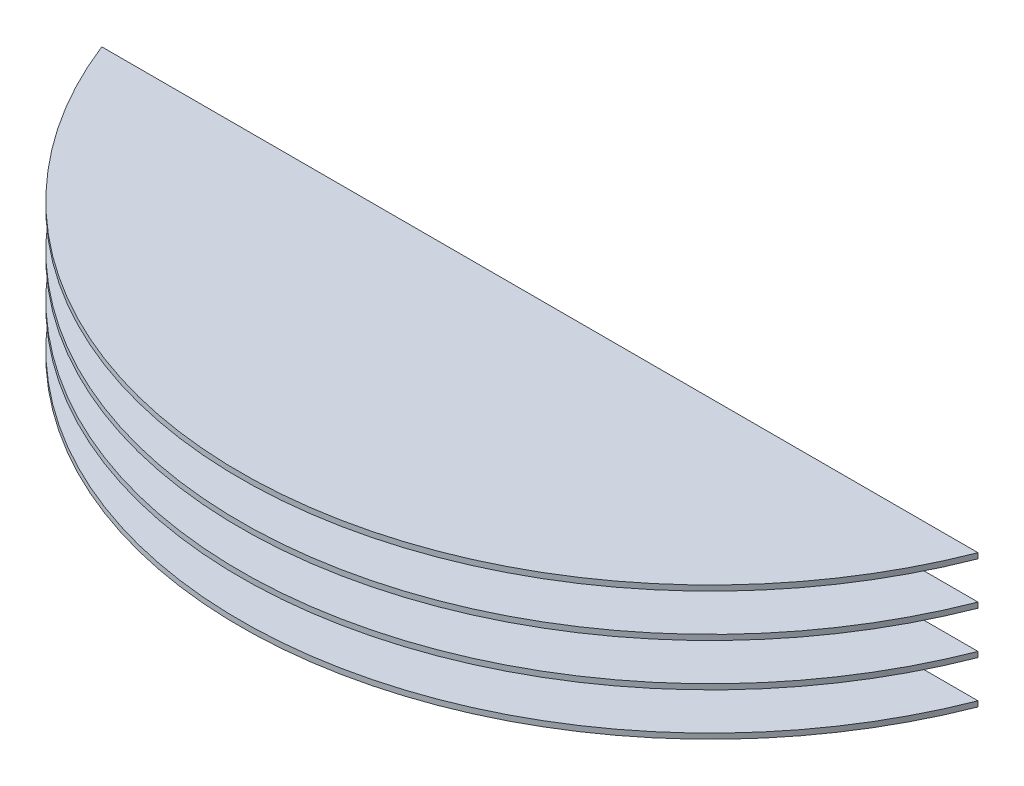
ISO-10303-21;
HEADER;
FILE_DESCRIPTION(('STEP AP214'),'2;1');
FILE_NAME('part.step','',(''),(''),'','','');
FILE_SCHEMA(('AUTOMOTIVE_DESIGN { 1 0 10303 214 1 1 1 1 }'));
ENDSEC;
DATA;
#1=APPLICATION_CONTEXT('core data for automotive mechanical design processes');
#2=APPLICATION_PROTOCOL_DEFINITION('international standard','automotive_design',2000,#1);
#3=PRODUCT_CONTEXT('',#1,'mechanical');
#4=PRODUCT('Part','Part','',(#3));
#5=PRODUCT_RELATED_PRODUCT_CATEGORY('part','',(#4));
#6=PRODUCT_DEFINITION_FORMATION('','',#4);
#7=PRODUCT_DEFINITION_CONTEXT('part definition',#1,'design');
#8=PRODUCT_DEFINITION('design','',#6,#7);
#9=PRODUCT_DEFINITION_SHAPE('','',#8);
#10=(LENGTH_UNIT() NAMED_UNIT(*) SI_UNIT(.MILLI.,.METRE.));
#11=(NAMED_UNIT(*) PLANE_ANGLE_UNIT() SI_UNIT($,.RADIAN.));
#12=(NAMED_UNIT(*) SI_UNIT($,.STERADIAN.) SOLID_ANGLE_UNIT());
#13=UNCERTAINTY_MEASURE_WITH_UNIT(LENGTH_MEASURE(1.E-05),#10,'distance_accuracy_value','');
#14=(GEOMETRIC_REPRESENTATION_CONTEXT(3) GLOBAL_UNCERTAINTY_ASSIGNED_CONTEXT((#13)) GLOBAL_UNIT_ASSIGNED_CONTEXT((#10,
#11,#12)) REPRESENTATION_CONTEXT('',''));
#15=CARTESIAN_POINT('',(0.,0.,0.));
#16=DIRECTION('',(0.,0.,1.));
#17=DIRECTION('',(1.,0.,0.));
#18=AXIS2_PLACEMENT_3D('',#15,#16,#17);
#19=CARTESIAN_POINT('',(38.1000000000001,30.1625,-2.66050878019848E-13));
#20=DIRECTION('',(0.,-1.,0.));
#21=DIRECTION('',(0.,0.,-1.));
#22=AXIS2_PLACEMENT_3D('',#19,#20,#21);
#23=PLANE('',#22);
#24=CARTESIAN_POINT('',(0.,30.1625,0.));
#25=DIRECTION('',(0.,-1.,0.));
#26=DIRECTION('',(0.,0.,-1.));
#27=AXIS2_PLACEMENT_3D('',#24,#25,#26);
#28=CIRCLE('',#27,139.7);
#29=CARTESIAN_POINT('',(130.136274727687,30.1625,50.8));
#30=VERTEX_POINT('',#29);
#31=CARTESIAN_POINT('',(-130.136274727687,30.1625,50.8));
#32=VERTEX_POINT('',#31);
#33=EDGE_CURVE('E53',#30,#32,#28,.T.);
#34=ORIENTED_EDGE('',*,*,#33,.F.);
#35=DIRECTION('',(1.,0.,0.));
#36=VECTOR('',#35,1.);
#37=CARTESIAN_POINT('',(0.,30.1625,50.8));
#38=LINE('',#37,#36);
#39=EDGE_CURVE('E70',#32,#30,#38,.T.);
#40=ORIENTED_EDGE('',*,*,#39,.F.);
#41=EDGE_LOOP('',(#34,#40));
#42=FACE_BOUND('',#41,.T.);
#43=ADVANCED_FACE('F46',(#42),#23,.F.);
#44=CARTESIAN_POINT('',(0.,-0.802394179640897,0.));
#45=DIRECTION('',(0.,-1.,0.));
#46=DIRECTION('',(0.,0.,-1.));
#47=AXIS2_PLACEMENT_3D('',#44,#45,#46);
#48=CYLINDRICAL_SURFACE('',#47,139.7);
#49=ORIENTED_EDGE('',*,*,#33,.T.);
#50=DIRECTION('',(0.,-1.,0.));
#51=VECTOR('',#50,1.);
#52=CARTESIAN_POINT('',(-130.136274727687,-0.802394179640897,50.8));
#53=LINE('',#52,#51);
#54=CARTESIAN_POINT('',(-130.136274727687,28.575,50.8));
#55=VERTEX_POINT('',#54);
#56=EDGE_CURVE('E67',#32,#55,#53,.T.);
#57=ORIENTED_EDGE('',*,*,#56,.T.);
#58=CARTESIAN_POINT('',(0.,28.575,0.));
#59=DIRECTION('',(0.,-1.,0.));
#60=DIRECTION('',(0.,0.,-1.));
#61=AXIS2_PLACEMENT_3D('',#58,#59,#60);
#62=CIRCLE('',#61,139.7);
#63=CARTESIAN_POINT('',(130.136274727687,28.575,50.8));
#64=VERTEX_POINT('',#63);
#65=EDGE_CURVE('E75',#64,#55,#62,.T.);
#66=ORIENTED_EDGE('',*,*,#65,.F.);
#67=DIRECTION('',(0.,-1.,0.));
#68=VECTOR('',#67,1.);
#69=CARTESIAN_POINT('',(130.136274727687,-0.802394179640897,50.8));
#70=LINE('',#69,#68);
#71=EDGE_CURVE('E60',#64,#30,#70,.F.);
#72=ORIENTED_EDGE('',*,*,#71,.T.);
#73=EDGE_LOOP('',(#49,#57,#66,#72));
#74=FACE_BOUND('',#73,.T.);
#75=ADVANCED_FACE('F80',(#74),#48,.T.);
#76=CARTESIAN_POINT('',(38.1000000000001,28.575,-2.66050878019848E-13));
#77=DIRECTION('',(0.,1.,0.));
#78=DIRECTION('',(0.,0.,1.));
#79=AXIS2_PLACEMENT_3D('',#76,#77,#78);
#80=PLANE('',#79);
#81=ORIENTED_EDGE('',*,*,#65,.T.);
#82=DIRECTION('',(1.,0.,0.));
#83=VECTOR('',#82,1.);
#84=CARTESIAN_POINT('',(38.1000000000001,28.575,50.8));
#85=LINE('',#84,#83);
#86=EDGE_CURVE('E12',#55,#64,#85,.T.);
#87=ORIENTED_EDGE('',*,*,#86,.T.);
#88=EDGE_LOOP('',(#81,#87));
#89=FACE_BOUND('',#88,.T.);
#90=ADVANCED_FACE('F84',(#89),#80,.F.);
#91=CARTESIAN_POINT('',(0.,-9.52500000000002,50.8));
#92=DIRECTION('',(0.,0.,1.));
#93=DIRECTION('',(1.,0.,0.));
#94=AXIS2_PLACEMENT_3D('',#91,#92,#93);
#95=PLANE('',#94);
#96=ORIENTED_EDGE('',*,*,#39,.T.);
#97=ORIENTED_EDGE('',*,*,#71,.F.);
#98=ORIENTED_EDGE('',*,*,#86,.F.);
#99=ORIENTED_EDGE('',*,*,#56,.F.);
#100=EDGE_LOOP('',(#96,#97,#98,#99));
#101=FACE_BOUND('',#100,.T.);
#102=ADVANCED_FACE('F69',(#101),#95,.F.);
#103=CLOSED_SHELL('',(#43,#75,#90,#102));
#104=MANIFOLD_SOLID_BREP('B2',#103);
#105=CARTESIAN_POINT('',(38.1000000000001,17.4625,-2.66050878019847E-13));
#106=DIRECTION('',(0.,-1.,0.));
#107=DIRECTION('',(0.,0.,-1.));
#108=AXIS2_PLACEMENT_3D('',#105,#106,#107);
#109=PLANE('',#108);
#110=CARTESIAN_POINT('',(0.,17.4625,0.));
#111=DIRECTION('',(0.,-1.,0.));
#112=DIRECTION('',(0.,0.,-1.));
#113=AXIS2_PLACEMENT_3D('',#110,#111,#112);
#114=CIRCLE('',#113,139.7);
#115=CARTESIAN_POINT('',(130.136274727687,17.4625,50.8));
#116=VERTEX_POINT('',#115);
#117=CARTESIAN_POINT('',(-130.136274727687,17.4625,50.8));
#118=VERTEX_POINT('',#117);
#119=EDGE_CURVE('E138',#116,#118,#114,.T.);
#120=ORIENTED_EDGE('',*,*,#119,.F.);
#121=DIRECTION('',(-1.,0.,0.));
#122=VECTOR('',#121,1.);
#123=CARTESIAN_POINT('',(38.1000000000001,17.4625,50.8));
#124=LINE('',#123,#122);
#125=EDGE_CURVE('E163',#116,#118,#124,.T.);
#126=ORIENTED_EDGE('',*,*,#125,.T.);
#127=EDGE_LOOP('',(#120,#126));
#128=FACE_BOUND('',#127,.T.);
#129=ADVANCED_FACE('F131',(#128),#109,.F.);
#130=CARTESIAN_POINT('',(0.,-0.802394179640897,0.));
#131=DIRECTION('',(0.,-1.,0.));
#132=DIRECTION('',(0.,0.,-1.));
#133=AXIS2_PLACEMENT_3D('',#130,#131,#132);
#134=CYLINDRICAL_SURFACE('',#133,139.7);
#135=ORIENTED_EDGE('',*,*,#119,.T.);
#136=DIRECTION('',(0.,-1.,0.));
#137=VECTOR('',#136,1.);
#138=CARTESIAN_POINT('',(-130.136274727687,-0.802394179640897,50.8));
#139=LINE('',#138,#137);
#140=CARTESIAN_POINT('',(-130.136274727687,15.875,50.8));
#141=VERTEX_POINT('',#140);
#142=EDGE_CURVE('E149',#118,#141,#139,.T.);
#143=ORIENTED_EDGE('',*,*,#142,.T.);
#144=CARTESIAN_POINT('',(0.,15.875,0.));
#145=DIRECTION('',(0.,-1.,0.));
#146=DIRECTION('',(0.,0.,-1.));
#147=AXIS2_PLACEMENT_3D('',#144,#145,#146);
#148=CIRCLE('',#147,139.7);
#149=CARTESIAN_POINT('',(130.136274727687,15.875,50.8));
#150=VERTEX_POINT('',#149);
#151=EDGE_CURVE('E161',#150,#141,#148,.T.);
#152=ORIENTED_EDGE('',*,*,#151,.F.);
#153=DIRECTION('',(0.,-1.,0.));
#154=VECTOR('',#153,1.);
#155=CARTESIAN_POINT('',(130.136274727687,-0.802394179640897,50.8));
#156=LINE('',#155,#154);
#157=EDGE_CURVE('E145',#150,#116,#156,.F.);
#158=ORIENTED_EDGE('',*,*,#157,.T.);
#159=EDGE_LOOP('',(#135,#143,#152,#158));
#160=FACE_BOUND('',#159,.T.);
#161=ADVANCED_FACE('F160',(#160),#134,.T.);
#162=CARTESIAN_POINT('',(38.1000000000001,15.875,-2.66050878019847E-13));
#163=DIRECTION('',(0.,1.,0.));
#164=DIRECTION('',(0.,0.,1.));
#165=AXIS2_PLACEMENT_3D('',#162,#163,#164);
#166=PLANE('',#165);
#167=ORIENTED_EDGE('',*,*,#151,.T.);
#168=DIRECTION('',(1.,0.,0.));
#169=VECTOR('',#168,1.);
#170=CARTESIAN_POINT('',(38.1000000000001,15.875,50.8));
#171=LINE('',#170,#169);
#172=EDGE_CURVE('E44',#141,#150,#171,.T.);
#173=ORIENTED_EDGE('',*,*,#172,.T.);
#174=EDGE_LOOP('',(#167,#173));
#175=FACE_BOUND('',#174,.T.);
#176=ADVANCED_FACE('F165',(#175),#166,.F.);
#177=CARTESIAN_POINT('',(0.,-9.52500000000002,50.8));
#178=DIRECTION('',(0.,0.,1.));
#179=DIRECTION('',(1.,0.,0.));
#180=AXIS2_PLACEMENT_3D('',#177,#178,#179);
#181=PLANE('',#180);
#182=ORIENTED_EDGE('',*,*,#157,.F.);
#183=ORIENTED_EDGE('',*,*,#172,.F.);
#184=ORIENTED_EDGE('',*,*,#142,.F.);
#185=ORIENTED_EDGE('',*,*,#125,.F.);
#186=EDGE_LOOP('',(#182,#183,#184,#185));
#187=FACE_BOUND('',#186,.T.);
#188=ADVANCED_FACE('F154',(#187),#181,.F.);
#189=CLOSED_SHELL('',(#129,#161,#176,#188));
#190=MANIFOLD_SOLID_BREP('B6',#189);
#191=CARTESIAN_POINT('',(38.1,4.76249999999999,-2.66050878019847E-13));
#192=DIRECTION('',(0.,-1.,0.));
#193=DIRECTION('',(0.,0.,-1.));
#194=AXIS2_PLACEMENT_3D('',#191,#192,#193);
#195=PLANE('',#194);
#196=CARTESIAN_POINT('',(0.,4.76249999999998,0.));
#197=DIRECTION('',(0.,-1.,0.));
#198=DIRECTION('',(0.,0.,-1.));
#199=AXIS2_PLACEMENT_3D('',#196,#197,#198);
#200=CIRCLE('',#199,139.7);
#201=CARTESIAN_POINT('',(130.136274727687,4.76249999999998,50.8));
#202=VERTEX_POINT('',#201);
#203=CARTESIAN_POINT('',(-130.136274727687,4.76249999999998,50.8));
#204=VERTEX_POINT('',#203);
#205=EDGE_CURVE('E222',#202,#204,#200,.T.);
#206=ORIENTED_EDGE('',*,*,#205,.F.);
#207=DIRECTION('',(-1.,0.,0.));
#208=VECTOR('',#207,1.);
#209=CARTESIAN_POINT('',(38.1000000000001,4.76249999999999,50.8));
#210=LINE('',#209,#208);
#211=EDGE_CURVE('E247',#202,#204,#210,.T.);
#212=ORIENTED_EDGE('',*,*,#211,.T.);
#213=EDGE_LOOP('',(#206,#212));
#214=FACE_BOUND('',#213,.T.);
#215=ADVANCED_FACE('F215',(#214),#195,.F.);
#216=CARTESIAN_POINT('',(0.,-0.802394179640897,0.));
#217=DIRECTION('',(0.,-1.,0.));
#218=DIRECTION('',(0.,0.,-1.));
#219=AXIS2_PLACEMENT_3D('',#216,#217,#218);
#220=CYLINDRICAL_SURFACE('',#219,139.7);
#221=ORIENTED_EDGE('',*,*,#205,.T.);
#222=DIRECTION('',(0.,-1.,0.));
#223=VECTOR('',#222,1.);
#224=CARTESIAN_POINT('',(-130.136274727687,-0.802394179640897,50.8));
#225=LINE('',#224,#223);
#226=CARTESIAN_POINT('',(-130.136274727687,3.17499999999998,50.8));
#227=VERTEX_POINT('',#226);
#228=EDGE_CURVE('E233',#204,#227,#225,.T.);
#229=ORIENTED_EDGE('',*,*,#228,.T.);
#230=CARTESIAN_POINT('',(0.,3.17499999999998,0.));
#231=DIRECTION('',(0.,-1.,0.));
#232=DIRECTION('',(0.,0.,-1.));
#233=AXIS2_PLACEMENT_3D('',#230,#231,#232);
#234=CIRCLE('',#233,139.7);
#235=CARTESIAN_POINT('',(130.136274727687,3.17499999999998,50.8));
#236=VERTEX_POINT('',#235);
#237=EDGE_CURVE('E245',#236,#227,#234,.T.);
#238=ORIENTED_EDGE('',*,*,#237,.F.);
#239=DIRECTION('',(0.,-1.,0.));
#240=VECTOR('',#239,1.);
#241=CARTESIAN_POINT('',(130.136274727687,-0.802394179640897,50.8));
#242=LINE('',#241,#240);
#243=EDGE_CURVE('E229',#236,#202,#242,.F.);
#244=ORIENTED_EDGE('',*,*,#243,.T.);
#245=EDGE_LOOP('',(#221,#229,#238,#244));
#246=FACE_BOUND('',#245,.T.);
#247=ADVANCED_FACE('F244',(#246),#220,.T.);
#248=CARTESIAN_POINT('',(38.1,3.17499999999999,-2.66050878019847E-13));
#249=DIRECTION('',(0.,1.,0.));
#250=DIRECTION('',(0.,0.,1.));
#251=AXIS2_PLACEMENT_3D('',#248,#249,#250);
#252=PLANE('',#251);
#253=ORIENTED_EDGE('',*,*,#237,.T.);
#254=DIRECTION('',(1.,0.,0.));
#255=VECTOR('',#254,1.);
#256=CARTESIAN_POINT('',(38.1000000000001,3.17499999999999,50.8));
#257=LINE('',#256,#255);
#258=EDGE_CURVE('E129',#227,#236,#257,.T.);
#259=ORIENTED_EDGE('',*,*,#258,.T.);
#260=EDGE_LOOP('',(#253,#259));
#261=FACE_BOUND('',#260,.T.);
#262=ADVANCED_FACE('F249',(#261),#252,.F.);
#263=CARTESIAN_POINT('',(0.,-9.52500000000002,50.8));
#264=DIRECTION('',(0.,0.,1.));
#265=DIRECTION('',(1.,0.,0.));
#266=AXIS2_PLACEMENT_3D('',#263,#264,#265);
#267=PLANE('',#266);
#268=ORIENTED_EDGE('',*,*,#243,.F.);
#269=ORIENTED_EDGE('',*,*,#258,.F.);
#270=ORIENTED_EDGE('',*,*,#228,.F.);
#271=ORIENTED_EDGE('',*,*,#211,.F.);
#272=EDGE_LOOP('',(#268,#269,#270,#271));
#273=FACE_BOUND('',#272,.T.);
#274=ADVANCED_FACE('F238',(#273),#267,.F.);
#275=CLOSED_SHELL('',(#215,#247,#262,#274));
#276=MANIFOLD_SOLID_BREP('B38',#275);
#277=CARTESIAN_POINT('',(38.1,-7.93750000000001,-2.66050878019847E-13));
#278=DIRECTION('',(0.,-1.,0.));
#279=DIRECTION('',(0.,0.,-1.));
#280=AXIS2_PLACEMENT_3D('',#277,#278,#279);
#281=PLANE('',#280);
#282=CARTESIAN_POINT('',(0.,-7.93750000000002,0.));
#283=DIRECTION('',(0.,-1.,0.));
#284=DIRECTION('',(0.,0.,-1.));
#285=AXIS2_PLACEMENT_3D('',#282,#283,#284);
#286=CIRCLE('',#285,139.7);
#287=CARTESIAN_POINT('',(130.136274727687,-7.93750000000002,50.8));
#288=VERTEX_POINT('',#287);
#289=CARTESIAN_POINT('',(-130.136274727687,-7.93750000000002,50.8));
#290=VERTEX_POINT('',#289);
#291=EDGE_CURVE('E324',#288,#290,#286,.T.);
#292=ORIENTED_EDGE('',*,*,#291,.F.);
#293=DIRECTION('',(-1.,0.,0.));
#294=VECTOR('',#293,1.);
#295=CARTESIAN_POINT('',(38.1,-7.93750000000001,50.8));
#296=LINE('',#295,#294);
#297=EDGE_CURVE('E305',#288,#290,#296,.T.);
#298=ORIENTED_EDGE('',*,*,#297,.T.);
#299=EDGE_LOOP('',(#292,#298));
#300=FACE_BOUND('',#299,.T.);
#301=ADVANCED_FACE('F290',(#300),#281,.F.);
#302=CARTESIAN_POINT('',(38.1,-9.52500000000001,-2.66050878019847E-13));
#303=DIRECTION('',(0.,1.,0.));
#304=DIRECTION('',(0.,0.,1.));
#305=AXIS2_PLACEMENT_3D('',#302,#303,#304);
#306=PLANE('',#305);
#307=CARTESIAN_POINT('',(0.,-9.52500000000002,0.));
#308=DIRECTION('',(0.,-1.,0.));
#309=DIRECTION('',(0.,0.,-1.));
#310=AXIS2_PLACEMENT_3D('',#307,#308,#309);
#311=CIRCLE('',#310,139.7);
#312=CARTESIAN_POINT('',(130.136274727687,-9.52500000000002,50.8));
#313=VERTEX_POINT('',#312);
#314=CARTESIAN_POINT('',(-130.136274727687,-9.52500000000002,50.8));
#315=VERTEX_POINT('',#314);
#316=EDGE_CURVE('E322',#313,#315,#311,.T.);
#317=ORIENTED_EDGE('',*,*,#316,.T.);
#318=DIRECTION('',(1.,0.,0.));
#319=VECTOR('',#318,1.);
#320=CARTESIAN_POINT('',(0.,-9.52500000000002,50.8));
#321=LINE('',#320,#319);
#322=EDGE_CURVE('E313',#315,#313,#321,.T.);
#323=ORIENTED_EDGE('',*,*,#322,.T.);
#324=EDGE_LOOP('',(#317,#323));
#325=FACE_BOUND('',#324,.T.);
#326=ADVANCED_FACE('F292',(#325),#306,.F.);
#327=CARTESIAN_POINT('',(0.,-0.802394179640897,0.));
#328=DIRECTION('',(0.,-1.,0.));
#329=DIRECTION('',(0.,0.,-1.));
#330=AXIS2_PLACEMENT_3D('',#327,#328,#329);
#331=CYLINDRICAL_SURFACE('',#330,139.7);
#332=ORIENTED_EDGE('',*,*,#291,.T.);
#333=DIRECTION('',(0.,-1.,0.));
#334=VECTOR('',#333,1.);
#335=CARTESIAN_POINT('',(-130.136274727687,-0.802394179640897,50.8));
#336=LINE('',#335,#334);
#337=EDGE_CURVE('E213',#290,#315,#336,.T.);
#338=ORIENTED_EDGE('',*,*,#337,.T.);
#339=ORIENTED_EDGE('',*,*,#316,.F.);
#340=DIRECTION('',(0.,-1.,0.));
#341=VECTOR('',#340,1.);
#342=CARTESIAN_POINT('',(130.136274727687,-0.802394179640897,50.8));
#343=LINE('',#342,#341);
#344=EDGE_CURVE('E298',#313,#288,#343,.F.);
#345=ORIENTED_EDGE('',*,*,#344,.T.);
#346=EDGE_LOOP('',(#332,#338,#339,#345));
#347=FACE_BOUND('',#346,.T.);
#348=ADVANCED_FACE('F321',(#347),#331,.T.);
#349=CARTESIAN_POINT('',(0.,-9.52500000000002,50.8));
#350=DIRECTION('',(0.,0.,1.));
#351=DIRECTION('',(1.,0.,0.));
#352=AXIS2_PLACEMENT_3D('',#349,#350,#351);
#353=PLANE('',#352);
#354=ORIENTED_EDGE('',*,*,#297,.F.);
#355=ORIENTED_EDGE('',*,*,#344,.F.);
#356=ORIENTED_EDGE('',*,*,#322,.F.);
#357=ORIENTED_EDGE('',*,*,#337,.F.);
#358=EDGE_LOOP('',(#354,#355,#356,#357));
#359=FACE_BOUND('',#358,.T.);
#360=ADVANCED_FACE('F314',(#359),#353,.F.);
#361=CLOSED_SHELL('',(#301,#326,#348,#360));
#362=MANIFOLD_SOLID_BREP('B123',#361);
#363=ADVANCED_BREP_SHAPE_REPRESENTATION('',(#18,#104,#190,#276,#362),#14);
#364=SHAPE_DEFINITION_REPRESENTATION(#9,#363);
ENDSEC;
END-ISO-10303-21;
